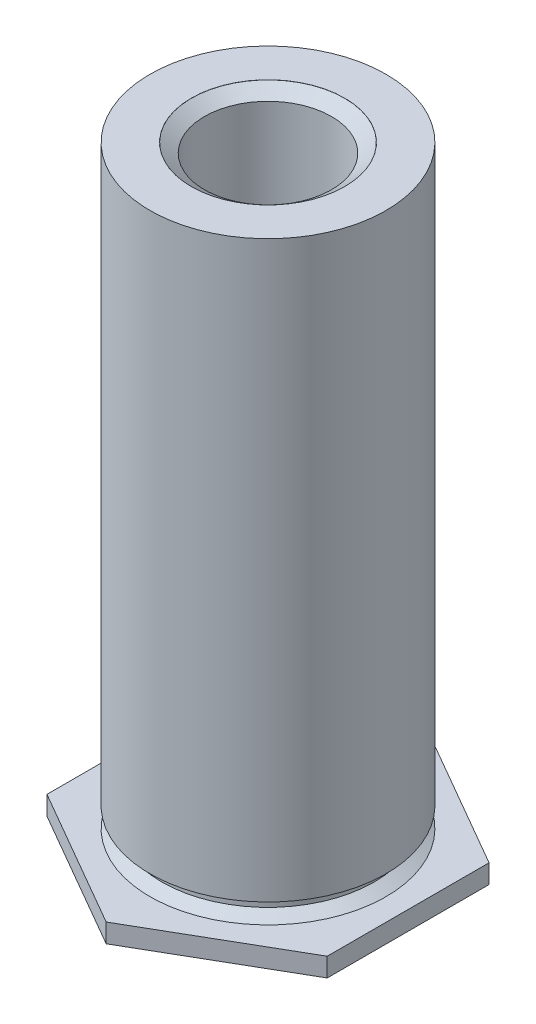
from build123d import *

# Parameters (mm, degrees)
HEXDIESKE_R  = 3.7125
HEXDIE_DEPTH = 0.4312


with BuildPart() as part:
    # BodySke → Body (revolve)
    with BuildSketch(Plane.XY, mode=Mode.PRIVATE) as body_sk:
        Polygon((2.695, 0), (3.712, 0), (3.712, 0.4312), (2.695, 0.4312), (2.4255, 0.586795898), (2.4255, 0.88396), (2.695, 0.88396), (2.695, 14), (1.45, 14), (1.45, 7), (0, 7), (0, 0.00254), (2.695, 0.00254), align=None)
    revolve(body_sk.sketch.rotate(Axis((0, 0, 0), (0, 1, 0)), 90), axis=Axis((0, 0, 0), (0, 1, 0)))

    # TapDriSke → TapDrill (revolve, cut)
    with BuildSketch(Plane.XY, mode=Mode.PRIVATE) as tapdrill_sk:
        Polygon((1.45, 4), (1.45, 14), (0, 14), (0, 3.399390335), align=None)
    revolve(tapdrill_sk.sketch.rotate(Axis((0, 0, 0), (0, 1, 0)), 90), axis=Axis((0, 0, 0), (0, 1, 0)), mode=Mode.SUBTRACT)

    # EndChamferSke → EndChamfer (revolve, cut)
    with BuildSketch(Plane.XY, mode=Mode.PRIVATE) as endchamfer_sk:
        Polygon((1.7515, 13.99746), (1.7515, 14.254), (1.45, 14.254), (1.45, 13.78747576), (1.75, 13.99746), align=None)
    revolve(endchamfer_sk.sketch.rotate(Axis((0, -2.54, 0), (0, 1, 0)), 90), axis=Axis((0, -2.54, 0), (0, 1, 0)), mode=Mode.SUBTRACT)

    # HexDieSke → HexDie (cut)
    with BuildSketch(Plane(origin=(0, 0.4312, 0), x_dir=(-1, 0, 0), z_dir=(0, 1, 0))):
        Circle(HEXDIESKE_R)
        Polygon((0, 3.695041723), (3.2, 1.847520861), (3.2, -1.847520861), (0, -3.695041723), (-3.2, -1.847520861), (-3.2, 1.847520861), align=None, mode=Mode.SUBTRACT)
    extrude(amount=-HEXDIE_DEPTH, mode=Mode.SUBTRACT)


solid = part.part
